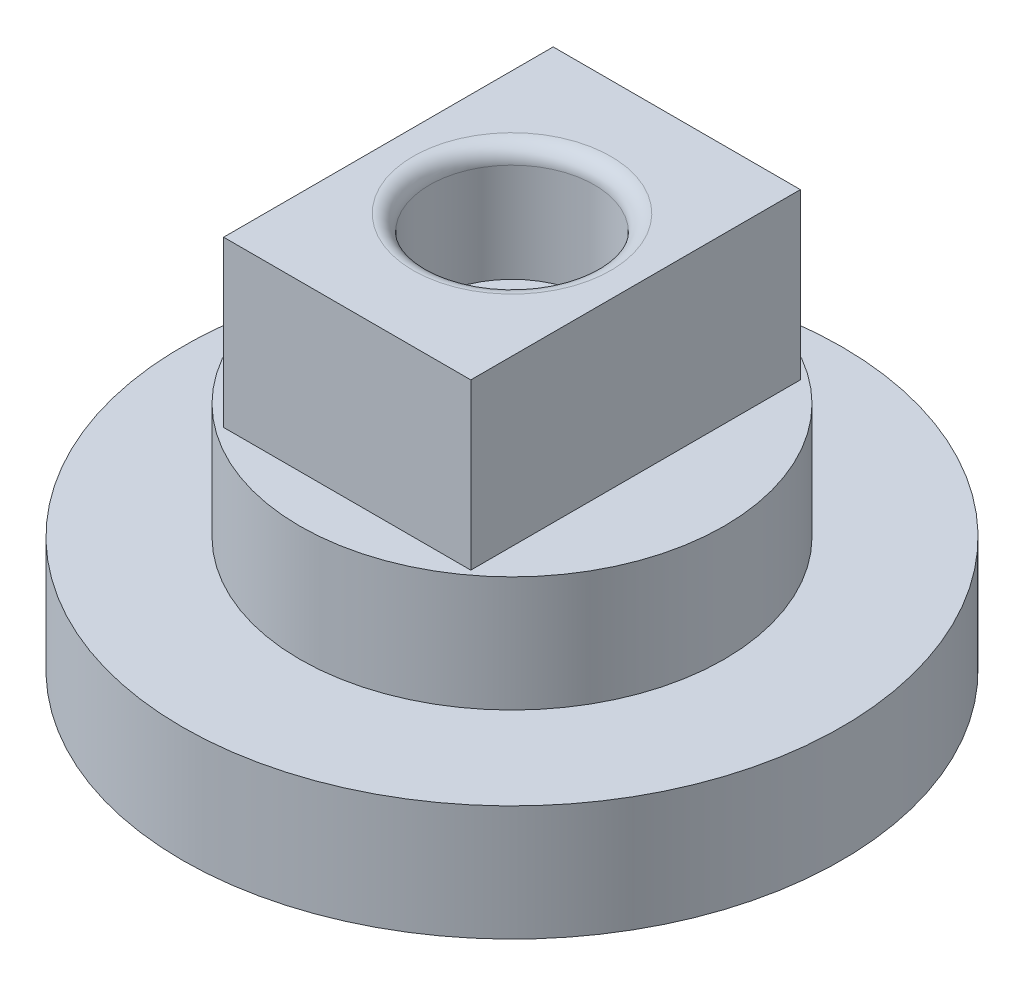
ISO-10303-21;
HEADER;
FILE_DESCRIPTION(('STEP AP214'),'2;1');
FILE_NAME('part.step','',(''),(''),'','','');
FILE_SCHEMA(('AUTOMOTIVE_DESIGN { 1 0 10303 214 1 1 1 1 }'));
ENDSEC;
DATA;
#1=APPLICATION_CONTEXT('core data for automotive mechanical design processes');
#2=APPLICATION_PROTOCOL_DEFINITION('international standard','automotive_design',2000,#1);
#3=PRODUCT_CONTEXT('',#1,'mechanical');
#4=PRODUCT('Part','Part','',(#3));
#5=PRODUCT_RELATED_PRODUCT_CATEGORY('part','',(#4));
#6=PRODUCT_DEFINITION_FORMATION('','',#4);
#7=PRODUCT_DEFINITION_CONTEXT('part definition',#1,'design');
#8=PRODUCT_DEFINITION('design','',#6,#7);
#9=PRODUCT_DEFINITION_SHAPE('','',#8);
#10=(LENGTH_UNIT() NAMED_UNIT(*) SI_UNIT(.MILLI.,.METRE.));
#11=(NAMED_UNIT(*) PLANE_ANGLE_UNIT() SI_UNIT($,.RADIAN.));
#12=(NAMED_UNIT(*) SI_UNIT($,.STERADIAN.) SOLID_ANGLE_UNIT());
#13=UNCERTAINTY_MEASURE_WITH_UNIT(LENGTH_MEASURE(1.E-05),#10,'distance_accuracy_value','');
#14=(GEOMETRIC_REPRESENTATION_CONTEXT(3) GLOBAL_UNCERTAINTY_ASSIGNED_CONTEXT((#13)) GLOBAL_UNIT_ASSIGNED_CONTEXT((#10,
#11,#12)) REPRESENTATION_CONTEXT('',''));
#15=CARTESIAN_POINT('',(0.,0.,0.));
#16=DIRECTION('',(0.,0.,1.));
#17=DIRECTION('',(1.,0.,0.));
#18=AXIS2_PLACEMENT_3D('',#15,#16,#17);
#19=CARTESIAN_POINT('',(0.,7.,0.));
#20=DIRECTION('',(0.,-1.,0.));
#21=DIRECTION('',(0.,0.,-1.));
#22=AXIS2_PLACEMENT_3D('',#19,#20,#21);
#23=CYLINDRICAL_SURFACE('',#22,20.);
#24=CARTESIAN_POINT('',(0.,7.,0.));
#25=DIRECTION('',(0.,1.,0.));
#26=DIRECTION('',(0.,0.,1.));
#27=AXIS2_PLACEMENT_3D('',#24,#25,#26);
#28=CIRCLE('',#27,20.);
#29=CARTESIAN_POINT('',(0.,7.,20.));
#30=VERTEX_POINT('',#29);
#31=EDGE_CURVE('E124',#30,#30,#28,.T.);
#32=ORIENTED_EDGE('',*,*,#31,.F.);
#33=EDGE_LOOP('',(#32));
#34=FACE_BOUND('',#33,.T.);
#35=CARTESIAN_POINT('',(0.,0.,0.));
#36=DIRECTION('',(0.,1.,0.));
#37=DIRECTION('',(0.,0.,1.));
#38=AXIS2_PLACEMENT_3D('',#35,#36,#37);
#39=CIRCLE('',#38,20.);
#40=CARTESIAN_POINT('',(0.,0.,20.));
#41=VERTEX_POINT('',#40);
#42=EDGE_CURVE('E114',#41,#41,#39,.T.);
#43=ORIENTED_EDGE('',*,*,#42,.T.);
#44=EDGE_LOOP('',(#43));
#45=FACE_BOUND('',#44,.T.);
#46=ADVANCED_FACE('F44',(#34,#45),#23,.T.);
#47=CARTESIAN_POINT('',(0.,7.,0.));
#48=DIRECTION('',(0.,1.,0.));
#49=DIRECTION('',(0.,0.,1.));
#50=AXIS2_PLACEMENT_3D('',#47,#48,#49);
#51=PLANE('',#50);
#52=CARTESIAN_POINT('',(0.,7.,0.));
#53=DIRECTION('',(0.,1.,0.));
#54=DIRECTION('',(0.,0.,1.));
#55=AXIS2_PLACEMENT_3D('',#52,#53,#54);
#56=CIRCLE('',#55,12.875);
#57=CARTESIAN_POINT('',(0.,7.,12.875));
#58=VERTEX_POINT('',#57);
#59=EDGE_CURVE('E120',#58,#58,#56,.T.);
#60=ORIENTED_EDGE('',*,*,#59,.F.);
#61=EDGE_LOOP('',(#60));
#62=FACE_BOUND('',#61,.T.);
#63=ORIENTED_EDGE('',*,*,#31,.T.);
#64=EDGE_LOOP('',(#63));
#65=FACE_BOUND('',#64,.T.);
#66=ADVANCED_FACE('F152',(#62,#65),#51,.T.);
#67=CARTESIAN_POINT('',(0.,0.,0.));
#68=DIRECTION('',(0.,1.,0.));
#69=DIRECTION('',(0.,0.,1.));
#70=AXIS2_PLACEMENT_3D('',#67,#68,#69);
#71=PLANE('',#70);
#72=CARTESIAN_POINT('',(0.,0.,15.));
#73=DIRECTION('',(0.,-1.,0.));
#74=DIRECTION('',(0.,0.,-1.));
#75=AXIS2_PLACEMENT_3D('',#72,#73,#74);
#76=CIRCLE('',#75,3.5);
#77=CARTESIAN_POINT('',(0.,0.,11.5));
#78=VERTEX_POINT('',#77);
#79=EDGE_CURVE('E223',#78,#78,#76,.T.);
#80=ORIENTED_EDGE('',*,*,#79,.F.);
#81=EDGE_LOOP('',(#80));
#82=FACE_BOUND('',#81,.T.);
#83=CARTESIAN_POINT('',(12.9903810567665,0.,-7.50000000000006));
#84=DIRECTION('',(0.,-1.,0.));
#85=DIRECTION('',(0.,0.,-1.));
#86=AXIS2_PLACEMENT_3D('',#83,#84,#85);
#87=CIRCLE('',#86,3.5);
#88=CARTESIAN_POINT('',(12.9903810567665,0.,-11.0000000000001));
#89=VERTEX_POINT('',#88);
#90=EDGE_CURVE('E231',#89,#89,#87,.T.);
#91=ORIENTED_EDGE('',*,*,#90,.F.);
#92=EDGE_LOOP('',(#91));
#93=FACE_BOUND('',#92,.T.);
#94=CARTESIAN_POINT('',(-12.9903810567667,0.,-7.49999999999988));
#95=DIRECTION('',(0.,-1.,0.));
#96=DIRECTION('',(0.,0.,-1.));
#97=AXIS2_PLACEMENT_3D('',#94,#95,#96);
#98=CIRCLE('',#97,3.5);
#99=CARTESIAN_POINT('',(-12.9903810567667,0.,-10.9999999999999));
#100=VERTEX_POINT('',#99);
#101=EDGE_CURVE('E241',#100,#100,#98,.T.);
#102=ORIENTED_EDGE('',*,*,#101,.F.);
#103=EDGE_LOOP('',(#102));
#104=FACE_BOUND('',#103,.T.);
#105=CARTESIAN_POINT('',(0.,0.,0.));
#106=DIRECTION('',(0.,-1.,0.));
#107=DIRECTION('',(0.,0.,-1.));
#108=AXIS2_PLACEMENT_3D('',#105,#106,#107);
#109=CIRCLE('',#108,5.);
#110=CARTESIAN_POINT('',(0.,0.,-5.));
#111=VERTEX_POINT('',#110);
#112=EDGE_CURVE('E222',#111,#111,#109,.T.);
#113=ORIENTED_EDGE('',*,*,#112,.F.);
#114=EDGE_LOOP('',(#113));
#115=FACE_BOUND('',#114,.T.);
#116=ORIENTED_EDGE('',*,*,#42,.F.);
#117=EDGE_LOOP('',(#116));
#118=FACE_BOUND('',#117,.T.);
#119=ADVANCED_FACE('F157',(#82,#93,#104,#115,#118),#71,.F.);
#120=CARTESIAN_POINT('',(0.,14.,0.));
#121=DIRECTION('',(0.,-1.,0.));
#122=DIRECTION('',(0.,0.,-1.));
#123=AXIS2_PLACEMENT_3D('',#120,#121,#122);
#124=CYLINDRICAL_SURFACE('',#123,12.875);
#125=CARTESIAN_POINT('',(0.,14.,0.));
#126=DIRECTION('',(0.,1.,0.));
#127=DIRECTION('',(0.,0.,1.));
#128=AXIS2_PLACEMENT_3D('',#125,#126,#127);
#129=CIRCLE('',#128,12.875);
#130=CARTESIAN_POINT('',(0.,14.,12.875));
#131=VERTEX_POINT('',#130);
#132=EDGE_CURVE('E109',#131,#131,#129,.T.);
#133=ORIENTED_EDGE('',*,*,#132,.F.);
#134=EDGE_LOOP('',(#133));
#135=FACE_BOUND('',#134,.T.);
#136=ORIENTED_EDGE('',*,*,#59,.T.);
#137=EDGE_LOOP('',(#136));
#138=FACE_BOUND('',#137,.T.);
#139=ADVANCED_FACE('F164',(#135,#138),#124,.T.);
#140=CARTESIAN_POINT('',(0.,14.,0.));
#141=DIRECTION('',(0.,1.,0.));
#142=DIRECTION('',(0.,0.,1.));
#143=AXIS2_PLACEMENT_3D('',#140,#141,#142);
#144=PLANE('',#143);
#145=DIRECTION('',(0.,0.,1.));
#146=VECTOR('',#145,1.);
#147=CARTESIAN_POINT('',(-7.5,14.,-10.));
#148=LINE('',#147,#146);
#149=CARTESIAN_POINT('',(-7.5,14.,-10.));
#150=VERTEX_POINT('',#149);
#151=CARTESIAN_POINT('',(-7.5,14.,10.));
#152=VERTEX_POINT('',#151);
#153=EDGE_CURVE('E60',#150,#152,#148,.T.);
#154=ORIENTED_EDGE('',*,*,#153,.F.);
#155=DIRECTION('',(-1.,0.,0.));
#156=VECTOR('',#155,1.);
#157=CARTESIAN_POINT('',(-7.5,14.,-10.));
#158=LINE('',#157,#156);
#159=CARTESIAN_POINT('',(7.5,14.,-10.));
#160=VERTEX_POINT('',#159);
#161=EDGE_CURVE('E64',#160,#150,#158,.T.);
#162=ORIENTED_EDGE('',*,*,#161,.F.);
#163=DIRECTION('',(0.,0.,-1.));
#164=VECTOR('',#163,1.);
#165=CARTESIAN_POINT('',(7.5,14.,-10.));
#166=LINE('',#165,#164);
#167=CARTESIAN_POINT('',(7.5,14.,10.));
#168=VERTEX_POINT('',#167);
#169=EDGE_CURVE('E266',#168,#160,#166,.T.);
#170=ORIENTED_EDGE('',*,*,#169,.F.);
#171=DIRECTION('',(1.,0.,0.));
#172=VECTOR('',#171,1.);
#173=CARTESIAN_POINT('',(-7.5,14.,10.));
#174=LINE('',#173,#172);
#175=EDGE_CURVE('E263',#152,#168,#174,.T.);
#176=ORIENTED_EDGE('',*,*,#175,.F.);
#177=EDGE_LOOP('',(#154,#162,#170,#176));
#178=FACE_BOUND('',#177,.T.);
#179=ORIENTED_EDGE('',*,*,#132,.T.);
#180=EDGE_LOOP('',(#179));
#181=FACE_BOUND('',#180,.T.);
#182=ADVANCED_FACE('F169',(#178,#181),#144,.T.);
#183=CARTESIAN_POINT('',(-7.5,24.,-10.));
#184=DIRECTION('',(1.,0.,0.));
#185=DIRECTION('',(0.,0.,-1.));
#186=AXIS2_PLACEMENT_3D('',#183,#184,#185);
#187=PLANE('',#186);
#188=ORIENTED_EDGE('',*,*,#153,.T.);
#189=DIRECTION('',(0.,-1.,0.));
#190=VECTOR('',#189,1.);
#191=CARTESIAN_POINT('',(-7.5,24.,10.));
#192=LINE('',#191,#190);
#193=CARTESIAN_POINT('',(-7.5,24.,10.));
#194=VERTEX_POINT('',#193);
#195=EDGE_CURVE('E89',#194,#152,#192,.T.);
#196=ORIENTED_EDGE('',*,*,#195,.F.);
#197=DIRECTION('',(0.,0.,1.));
#198=VECTOR('',#197,1.);
#199=CARTESIAN_POINT('',(-7.5,24.,-10.));
#200=LINE('',#199,#198);
#201=CARTESIAN_POINT('',(-7.5,24.,-10.));
#202=VERTEX_POINT('',#201);
#203=EDGE_CURVE('E96',#202,#194,#200,.T.);
#204=ORIENTED_EDGE('',*,*,#203,.F.);
#205=DIRECTION('',(0.,-1.,0.));
#206=VECTOR('',#205,1.);
#207=CARTESIAN_POINT('',(-7.5,24.,-10.));
#208=LINE('',#207,#206);
#209=EDGE_CURVE('E260',#202,#150,#208,.T.);
#210=ORIENTED_EDGE('',*,*,#209,.T.);
#211=EDGE_LOOP('',(#188,#196,#204,#210));
#212=FACE_BOUND('',#211,.T.);
#213=ADVANCED_FACE('F107',(#212),#187,.F.);
#214=CARTESIAN_POINT('',(-7.5,24.,10.));
#215=DIRECTION('',(0.,0.,-1.));
#216=DIRECTION('',(-1.,0.,0.));
#217=AXIS2_PLACEMENT_3D('',#214,#215,#216);
#218=PLANE('',#217);
#219=ORIENTED_EDGE('',*,*,#175,.T.);
#220=DIRECTION('',(0.,-1.,0.));
#221=VECTOR('',#220,1.);
#222=CARTESIAN_POINT('',(7.5,24.,10.));
#223=LINE('',#222,#221);
#224=CARTESIAN_POINT('',(7.5,24.,10.));
#225=VERTEX_POINT('',#224);
#226=EDGE_CURVE('E91',#225,#168,#223,.T.);
#227=ORIENTED_EDGE('',*,*,#226,.F.);
#228=DIRECTION('',(1.,0.,0.));
#229=VECTOR('',#228,1.);
#230=CARTESIAN_POINT('',(-7.5,24.,10.));
#231=LINE('',#230,#229);
#232=EDGE_CURVE('E84',#194,#225,#231,.T.);
#233=ORIENTED_EDGE('',*,*,#232,.F.);
#234=ORIENTED_EDGE('',*,*,#195,.T.);
#235=EDGE_LOOP('',(#219,#227,#233,#234));
#236=FACE_BOUND('',#235,.T.);
#237=ADVANCED_FACE('F87',(#236),#218,.F.);
#238=CARTESIAN_POINT('',(7.5,24.,-10.));
#239=DIRECTION('',(-1.,0.,0.));
#240=DIRECTION('',(0.,0.,1.));
#241=AXIS2_PLACEMENT_3D('',#238,#239,#240);
#242=PLANE('',#241);
#243=ORIENTED_EDGE('',*,*,#169,.T.);
#244=DIRECTION('',(0.,-1.,0.));
#245=VECTOR('',#244,1.);
#246=CARTESIAN_POINT('',(7.5,24.,-10.));
#247=LINE('',#246,#245);
#248=CARTESIAN_POINT('',(7.5,24.,-10.));
#249=VERTEX_POINT('',#248);
#250=EDGE_CURVE('E116',#249,#160,#247,.T.);
#251=ORIENTED_EDGE('',*,*,#250,.F.);
#252=DIRECTION('',(0.,0.,-1.));
#253=VECTOR('',#252,1.);
#254=CARTESIAN_POINT('',(7.5,24.,-10.));
#255=LINE('',#254,#253);
#256=EDGE_CURVE('E95',#225,#249,#255,.T.);
#257=ORIENTED_EDGE('',*,*,#256,.F.);
#258=ORIENTED_EDGE('',*,*,#226,.T.);
#259=EDGE_LOOP('',(#243,#251,#257,#258));
#260=FACE_BOUND('',#259,.T.);
#261=ADVANCED_FACE('F177',(#260),#242,.F.);
#262=CARTESIAN_POINT('',(-7.5,24.,-10.));
#263=DIRECTION('',(0.,0.,1.));
#264=DIRECTION('',(1.,0.,0.));
#265=AXIS2_PLACEMENT_3D('',#262,#263,#264);
#266=PLANE('',#265);
#267=ORIENTED_EDGE('',*,*,#161,.T.);
#268=ORIENTED_EDGE('',*,*,#209,.F.);
#269=DIRECTION('',(-1.,0.,0.));
#270=VECTOR('',#269,1.);
#271=CARTESIAN_POINT('',(-7.5,24.,-10.));
#272=LINE('',#271,#270);
#273=EDGE_CURVE('E101',#249,#202,#272,.T.);
#274=ORIENTED_EDGE('',*,*,#273,.F.);
#275=ORIENTED_EDGE('',*,*,#250,.T.);
#276=EDGE_LOOP('',(#267,#268,#274,#275));
#277=FACE_BOUND('',#276,.T.);
#278=ADVANCED_FACE('F180',(#277),#266,.F.);
#279=CARTESIAN_POINT('',(0.,24.,0.));
#280=DIRECTION('',(0.,1.,0.));
#281=DIRECTION('',(0.,0.,1.));
#282=AXIS2_PLACEMENT_3D('',#279,#280,#281);
#283=PLANE('',#282);
#284=CARTESIAN_POINT('',(0.,24.,0.));
#285=DIRECTION('',(0.,1.,0.));
#286=DIRECTION('',(0.,0.,1.));
#287=AXIS2_PLACEMENT_3D('',#284,#285,#286);
#288=CIRCLE('',#287,6.);
#289=CARTESIAN_POINT('',(0.,24.,6.));
#290=VERTEX_POINT('',#289);
#291=EDGE_CURVE('E11',#290,#290,#288,.F.);
#292=ORIENTED_EDGE('',*,*,#291,.T.);
#293=EDGE_LOOP('',(#292));
#294=FACE_BOUND('',#293,.T.);
#295=ORIENTED_EDGE('',*,*,#203,.T.);
#296=ORIENTED_EDGE('',*,*,#232,.T.);
#297=ORIENTED_EDGE('',*,*,#256,.T.);
#298=ORIENTED_EDGE('',*,*,#273,.T.);
#299=EDGE_LOOP('',(#295,#296,#297,#298));
#300=FACE_BOUND('',#299,.T.);
#301=ADVANCED_FACE('F99',(#294,#300),#283,.T.);
#302=CARTESIAN_POINT('',(0.,17.,0.));
#303=DIRECTION('',(0.,1.,0.));
#304=DIRECTION('',(0.,0.,1.));
#305=AXIS2_PLACEMENT_3D('',#302,#303,#304);
#306=CYLINDRICAL_SURFACE('',#305,5.);
#307=CARTESIAN_POINT('',(0.,23.,0.));
#308=DIRECTION('',(0.,1.,0.));
#309=DIRECTION('',(0.,0.,1.));
#310=AXIS2_PLACEMENT_3D('',#307,#308,#309);
#311=CIRCLE('',#310,5.);
#312=CARTESIAN_POINT('',(0.,23.,5.));
#313=VERTEX_POINT('',#312);
#314=EDGE_CURVE('E53',#313,#313,#311,.T.);
#315=ORIENTED_EDGE('',*,*,#314,.T.);
#316=EDGE_LOOP('',(#315));
#317=FACE_BOUND('',#316,.T.);
#318=CARTESIAN_POINT('',(0.,17.,0.));
#319=DIRECTION('',(0.,1.,0.));
#320=DIRECTION('',(0.,0.,1.));
#321=AXIS2_PLACEMENT_3D('',#318,#319,#320);
#322=CIRCLE('',#321,5.);
#323=CARTESIAN_POINT('',(0.,17.,5.));
#324=VERTEX_POINT('',#323);
#325=EDGE_CURVE('E251',#324,#324,#322,.T.);
#326=ORIENTED_EDGE('',*,*,#325,.F.);
#327=EDGE_LOOP('',(#326));
#328=FACE_BOUND('',#327,.T.);
#329=ADVANCED_FACE('F134',(#317,#328),#306,.F.);
#330=CARTESIAN_POINT('',(0.,17.,0.));
#331=DIRECTION('',(0.,1.,0.));
#332=DIRECTION('',(0.,0.,1.));
#333=AXIS2_PLACEMENT_3D('',#330,#331,#332);
#334=PLANE('',#333);
#335=ORIENTED_EDGE('',*,*,#325,.T.);
#336=EDGE_LOOP('',(#335));
#337=FACE_BOUND('',#336,.T.);
#338=ADVANCED_FACE('F139',(#337),#334,.T.);
#339=CARTESIAN_POINT('',(0.,23.,0.));
#340=DIRECTION('',(0.,1.,0.));
#341=DIRECTION('',(0.,0.,1.));
#342=AXIS2_PLACEMENT_3D('',#339,#340,#341);
#343=TOROIDAL_SURFACE('',#342,6.,1.);
#344=ORIENTED_EDGE('',*,*,#291,.F.);
#345=EDGE_LOOP('',(#344));
#346=FACE_BOUND('',#345,.T.);
#347=ORIENTED_EDGE('',*,*,#314,.F.);
#348=EDGE_LOOP('',(#347));
#349=FACE_BOUND('',#348,.T.);
#350=ADVANCED_FACE('F46',(#346,#349),#343,.T.);
#351=CARTESIAN_POINT('',(0.,3.,0.));
#352=DIRECTION('',(0.,-1.,0.));
#353=DIRECTION('',(0.,0.,-1.));
#354=AXIS2_PLACEMENT_3D('',#351,#352,#353);
#355=CYLINDRICAL_SURFACE('',#354,5.);
#356=CARTESIAN_POINT('',(0.,3.,0.));
#357=DIRECTION('',(0.,-1.,0.));
#358=DIRECTION('',(0.,0.,-1.));
#359=AXIS2_PLACEMENT_3D('',#356,#357,#358);
#360=CIRCLE('',#359,5.);
#361=CARTESIAN_POINT('',(0.,3.,-5.));
#362=VERTEX_POINT('',#361);
#363=EDGE_CURVE('E228',#362,#362,#360,.T.);
#364=ORIENTED_EDGE('',*,*,#363,.F.);
#365=EDGE_LOOP('',(#364));
#366=FACE_BOUND('',#365,.T.);
#367=ORIENTED_EDGE('',*,*,#112,.T.);
#368=EDGE_LOOP('',(#367));
#369=FACE_BOUND('',#368,.T.);
#370=ADVANCED_FACE('F138',(#366,#369),#355,.F.);
#371=CARTESIAN_POINT('',(0.,3.,0.));
#372=DIRECTION('',(0.,-1.,0.));
#373=DIRECTION('',(0.,0.,-1.));
#374=AXIS2_PLACEMENT_3D('',#371,#372,#373);
#375=PLANE('',#374);
#376=ORIENTED_EDGE('',*,*,#363,.T.);
#377=EDGE_LOOP('',(#376));
#378=FACE_BOUND('',#377,.T.);
#379=ADVANCED_FACE('F145',(#378),#375,.T.);
#380=CARTESIAN_POINT('',(-12.9903810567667,5.,-7.49999999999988));
#381=DIRECTION('',(0.,-1.,0.));
#382=DIRECTION('',(0.,0.,-1.));
#383=AXIS2_PLACEMENT_3D('',#380,#381,#382);
#384=CYLINDRICAL_SURFACE('',#383,3.5);
#385=CARTESIAN_POINT('',(-12.9903810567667,5.,-7.49999999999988));
#386=DIRECTION('',(0.,-1.,0.));
#387=DIRECTION('',(0.,0.,-1.));
#388=AXIS2_PLACEMENT_3D('',#385,#386,#387);
#389=CIRCLE('',#388,3.5);
#390=CARTESIAN_POINT('',(-12.9903810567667,5.,-10.9999999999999));
#391=VERTEX_POINT('',#390);
#392=EDGE_CURVE('E245',#391,#391,#389,.T.);
#393=ORIENTED_EDGE('',*,*,#392,.F.);
#394=EDGE_LOOP('',(#393));
#395=FACE_BOUND('',#394,.T.);
#396=ORIENTED_EDGE('',*,*,#101,.T.);
#397=EDGE_LOOP('',(#396));
#398=FACE_BOUND('',#397,.T.);
#399=ADVANCED_FACE('F192',(#395,#398),#384,.F.);
#400=CARTESIAN_POINT('',(-12.9903810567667,5.,-7.49999999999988));
#401=DIRECTION('',(0.,-1.,0.));
#402=DIRECTION('',(0.,0.,-1.));
#403=AXIS2_PLACEMENT_3D('',#400,#401,#402);
#404=PLANE('',#403);
#405=ORIENTED_EDGE('',*,*,#392,.T.);
#406=EDGE_LOOP('',(#405));
#407=FACE_BOUND('',#406,.T.);
#408=ADVANCED_FACE('F194',(#407),#404,.T.);
#409=CARTESIAN_POINT('',(12.9903810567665,5.,-7.50000000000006));
#410=DIRECTION('',(0.,-1.,0.));
#411=DIRECTION('',(0.,0.,-1.));
#412=AXIS2_PLACEMENT_3D('',#409,#410,#411);
#413=CYLINDRICAL_SURFACE('',#412,3.5);
#414=CARTESIAN_POINT('',(12.9903810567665,5.,-7.50000000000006));
#415=DIRECTION('',(0.,-1.,0.));
#416=DIRECTION('',(0.,0.,-1.));
#417=AXIS2_PLACEMENT_3D('',#414,#415,#416);
#418=CIRCLE('',#417,3.5);
#419=CARTESIAN_POINT('',(12.9903810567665,5.,-11.0000000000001));
#420=VERTEX_POINT('',#419);
#421=EDGE_CURVE('E237',#420,#420,#418,.T.);
#422=ORIENTED_EDGE('',*,*,#421,.F.);
#423=EDGE_LOOP('',(#422));
#424=FACE_BOUND('',#423,.T.);
#425=ORIENTED_EDGE('',*,*,#90,.T.);
#426=EDGE_LOOP('',(#425));
#427=FACE_BOUND('',#426,.T.);
#428=ADVANCED_FACE('F197',(#424,#427),#413,.F.);
#429=CARTESIAN_POINT('',(12.9903810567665,5.,-7.50000000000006));
#430=DIRECTION('',(0.,-1.,0.));
#431=DIRECTION('',(0.,0.,-1.));
#432=AXIS2_PLACEMENT_3D('',#429,#430,#431);
#433=PLANE('',#432);
#434=ORIENTED_EDGE('',*,*,#421,.T.);
#435=EDGE_LOOP('',(#434));
#436=FACE_BOUND('',#435,.T.);
#437=ADVANCED_FACE('F202',(#436),#433,.T.);
#438=CARTESIAN_POINT('',(0.,5.,15.));
#439=DIRECTION('',(0.,-1.,0.));
#440=DIRECTION('',(0.,0.,-1.));
#441=AXIS2_PLACEMENT_3D('',#438,#439,#440);
#442=CYLINDRICAL_SURFACE('',#441,3.5);
#443=CARTESIAN_POINT('',(0.,5.,15.));
#444=DIRECTION('',(0.,-1.,0.));
#445=DIRECTION('',(0.,0.,-1.));
#446=AXIS2_PLACEMENT_3D('',#443,#444,#445);
#447=CIRCLE('',#446,3.5);
#448=CARTESIAN_POINT('',(0.,5.,11.5));
#449=VERTEX_POINT('',#448);
#450=EDGE_CURVE('E220',#449,#449,#447,.T.);
#451=ORIENTED_EDGE('',*,*,#450,.F.);
#452=EDGE_LOOP('',(#451));
#453=FACE_BOUND('',#452,.T.);
#454=ORIENTED_EDGE('',*,*,#79,.T.);
#455=EDGE_LOOP('',(#454));
#456=FACE_BOUND('',#455,.T.);
#457=ADVANCED_FACE('F205',(#453,#456),#442,.F.);
#458=CARTESIAN_POINT('',(0.,5.,15.));
#459=DIRECTION('',(0.,-1.,0.));
#460=DIRECTION('',(0.,0.,-1.));
#461=AXIS2_PLACEMENT_3D('',#458,#459,#460);
#462=PLANE('',#461);
#463=ORIENTED_EDGE('',*,*,#450,.T.);
#464=EDGE_LOOP('',(#463));
#465=FACE_BOUND('',#464,.T.);
#466=ADVANCED_FACE('F212',(#465),#462,.T.);
#467=CLOSED_SHELL('',(#46,#66,#119,#139,#182,#213,#237,#261,#278,#301,#329,#338,#350,#370,#379,
#399,#408,#428,#437,#457,#466));
#468=MANIFOLD_SOLID_BREP('B2',#467);
#469=ADVANCED_BREP_SHAPE_REPRESENTATION('',(#18,#468),#14);
#470=SHAPE_DEFINITION_REPRESENTATION(#9,#469);
ENDSEC;
END-ISO-10303-21;
